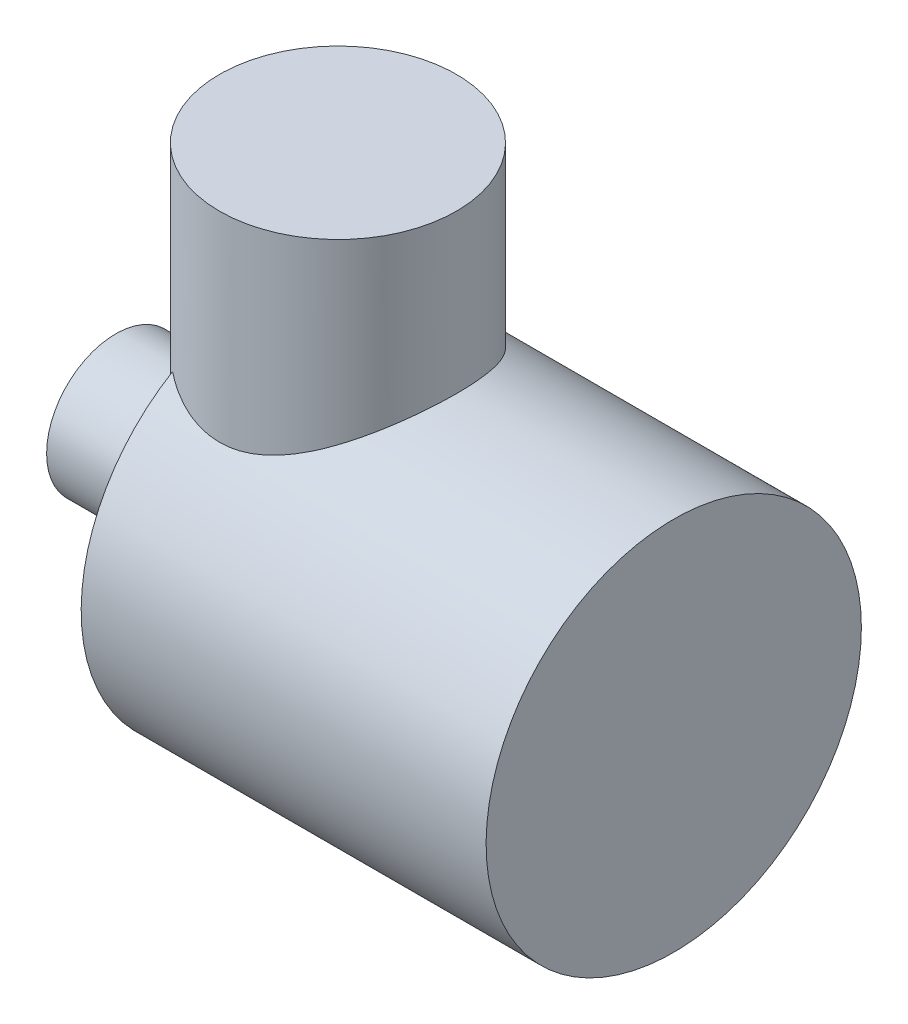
ISO-10303-21;
HEADER;
FILE_DESCRIPTION(('STEP AP214'),'2;1');
FILE_NAME('part.step','',(''),(''),'','','');
FILE_SCHEMA(('AUTOMOTIVE_DESIGN { 1 0 10303 214 1 1 1 1 }'));
ENDSEC;
DATA;
#1=APPLICATION_CONTEXT('core data for automotive mechanical design processes');
#2=APPLICATION_PROTOCOL_DEFINITION('international standard','automotive_design',2000,#1);
#3=PRODUCT_CONTEXT('',#1,'mechanical');
#4=PRODUCT('Part','Part','',(#3));
#5=PRODUCT_RELATED_PRODUCT_CATEGORY('part','',(#4));
#6=PRODUCT_DEFINITION_FORMATION('','',#4);
#7=PRODUCT_DEFINITION_CONTEXT('part definition',#1,'design');
#8=PRODUCT_DEFINITION('design','',#6,#7);
#9=PRODUCT_DEFINITION_SHAPE('','',#8);
#10=(LENGTH_UNIT() NAMED_UNIT(*) SI_UNIT(.MILLI.,.METRE.));
#11=(NAMED_UNIT(*) PLANE_ANGLE_UNIT() SI_UNIT($,.RADIAN.));
#12=(NAMED_UNIT(*) SI_UNIT($,.STERADIAN.) SOLID_ANGLE_UNIT());
#13=UNCERTAINTY_MEASURE_WITH_UNIT(LENGTH_MEASURE(1.E-05),#10,'distance_accuracy_value','');
#14=(GEOMETRIC_REPRESENTATION_CONTEXT(3) GLOBAL_UNCERTAINTY_ASSIGNED_CONTEXT((#13)) GLOBAL_UNIT_ASSIGNED_CONTEXT((#10,
#11,#12)) REPRESENTATION_CONTEXT('',''));
#15=CARTESIAN_POINT('',(0.,0.,0.));
#16=DIRECTION('',(0.,0.,1.));
#17=DIRECTION('',(1.,0.,0.));
#18=AXIS2_PLACEMENT_3D('',#15,#16,#17);
#19=CARTESIAN_POINT('',(-62.,0.,0.));
#20=DIRECTION('',(1.,0.,0.));
#21=DIRECTION('',(0.,0.,-1.));
#22=AXIS2_PLACEMENT_3D('',#19,#20,#21);
#23=CYLINDRICAL_SURFACE('',#22,28.);
#24=CARTESIAN_POINT('',(-62.,0.,0.));
#25=DIRECTION('',(-1.,0.,0.));
#26=DIRECTION('',(0.,0.,1.));
#27=AXIS2_PLACEMENT_3D('',#24,#25,#26);
#28=CIRCLE('',#27,28.);
#29=CARTESIAN_POINT('',(-62.,0.,28.));
#30=VERTEX_POINT('',#29);
#31=EDGE_CURVE('E138',#30,#30,#28,.T.);
#32=ORIENTED_EDGE('',*,*,#31,.F.);
#33=EDGE_LOOP('',(#32));
#34=FACE_BOUND('',#33,.T.);
#35=DIRECTION('',(1.,0.,0.));
#36=VECTOR('',#35,1.);
#37=CARTESIAN_POINT('',(-62.,-20.,19.5959179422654));
#38=LINE('',#37,#36);
#39=CARTESIAN_POINT('',(-15.8178046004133,-20.,19.5959179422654));
#40=VERTEX_POINT('',#39);
#41=CARTESIAN_POINT('',(0.,-20.,19.5959179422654));
#42=VERTEX_POINT('',#41);
#43=EDGE_CURVE('E11',#40,#42,#38,.T.);
#44=ORIENTED_EDGE('',*,*,#43,.F.);
#45=CARTESIAN_POINT('',(-15.8178046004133,-20.,19.5959179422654));
#46=CARTESIAN_POINT('',(-15.6934629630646,-19.7275715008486,19.8739575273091));
#47=CARTESIAN_POINT('',(-15.5685520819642,-19.4495092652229,20.1461614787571));
#48=CARTESIAN_POINT('',(-15.3183510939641,-18.8823827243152,20.6786600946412));
#49=CARTESIAN_POINT('',(-15.1930609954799,-18.5933186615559,20.9389550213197));
#50=CARTESIAN_POINT('',(-14.8176956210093,-17.7098697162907,21.7017527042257));
#51=CARTESIAN_POINT('',(-14.5681824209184,-17.0993520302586,22.1860418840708));
#52=CARTESIAN_POINT('',(-14.0749550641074,-15.8317996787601,23.1078793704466));
#53=CARTESIAN_POINT('',(-13.8313197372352,-15.1743741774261,23.5449334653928));
#54=CARTESIAN_POINT('',(-13.4775788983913,-14.1594504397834,24.1591872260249));
#55=CARTESIAN_POINT('',(-13.3616197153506,-13.8163527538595,24.3570467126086));
#56=CARTESIAN_POINT('',(-13.1344753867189,-13.1207166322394,24.7387198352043));
#57=CARTESIAN_POINT('',(-13.0232919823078,-12.7681748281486,24.9225283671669));
#58=CARTESIAN_POINT('',(-12.6975206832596,-11.694218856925,25.453580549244));
#59=CARTESIAN_POINT('',(-12.491639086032,-10.9590973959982,25.7788594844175));
#60=CARTESIAN_POINT('',(-12.1110795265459,-9.45653993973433,26.3671063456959));
#61=CARTESIAN_POINT('',(-11.9363950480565,-8.68911073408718,26.6300872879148));
#62=CARTESIAN_POINT('',(-11.7038557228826,-7.51942116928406,26.9744843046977));
#63=CARTESIAN_POINT('',(-11.6313712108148,-7.12722481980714,27.080777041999));
#64=CARTESIAN_POINT('',(-11.4969030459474,-6.33694195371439,27.2765243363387));
#65=CARTESIAN_POINT('',(-11.4349168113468,-5.93885691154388,27.3659830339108));
#66=CARTESIAN_POINT('',(-11.3222345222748,-5.13764462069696,27.5276515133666));
#67=CARTESIAN_POINT('',(-11.2715375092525,-4.73451780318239,27.5998627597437));
#68=CARTESIAN_POINT('',(-11.1821015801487,-3.9242053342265,27.7266816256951));
#69=CARTESIAN_POINT('',(-11.1433629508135,-3.51701958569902,27.781288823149));
#70=CARTESIAN_POINT('',(-11.0542641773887,-2.3956640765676,27.9065307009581));
#71=CARTESIAN_POINT('',(-11.0166713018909,-1.67829831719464,27.9589046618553));
#72=CARTESIAN_POINT('',(-10.981296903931,-0.240827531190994,28.0082013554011));
#73=CARTESIAN_POINT('',(-10.9835118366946,0.479277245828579,28.0051290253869));
#74=CARTESIAN_POINT('',(-11.0276357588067,1.91637493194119,27.9436051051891));
#75=CARTESIAN_POINT('',(-11.0695711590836,2.63336545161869,27.8851166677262));
#76=CARTESIAN_POINT('',(-11.1913245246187,4.05750840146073,27.7137341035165));
#77=CARTESIAN_POINT('',(-11.271142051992,4.76466094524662,27.6008406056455));
#78=CARTESIAN_POINT('',(-11.4553509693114,6.09193386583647,27.3367570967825));
#79=CARTESIAN_POINT('',(-11.5563888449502,6.71355101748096,27.190672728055));
#80=CARTESIAN_POINT('',(-11.7831726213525,7.9413462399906,26.857768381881));
#81=CARTESIAN_POINT('',(-11.9089260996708,8.54751951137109,26.6709359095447));
#82=CARTESIAN_POINT('',(-12.1815661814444,9.74146498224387,26.2583853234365));
#83=CARTESIAN_POINT('',(-12.3284504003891,10.3292392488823,26.0326715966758));
#84=CARTESIAN_POINT('',(-12.6396493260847,11.4843614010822,25.5441335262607));
#85=CARTESIAN_POINT('',(-12.803964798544,12.0517083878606,25.2813075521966));
#86=CARTESIAN_POINT('',(-13.1687942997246,13.2373817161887,24.6833661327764));
#87=CARTESIAN_POINT('',(-13.3712282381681,13.8526177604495,24.3432900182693));
#88=CARTESIAN_POINT('',(-13.7883470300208,15.0526578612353,23.6200818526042));
#89=CARTESIAN_POINT('',(-14.0030298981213,15.6374668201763,23.2369567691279));
#90=CARTESIAN_POINT('',(-14.4398658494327,16.7755343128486,22.4291943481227));
#91=CARTESIAN_POINT('',(-14.6620251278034,17.3287656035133,22.00452199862));
#92=CARTESIAN_POINT('',(-15.1088836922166,18.4014568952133,21.1156728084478));
#93=CARTESIAN_POINT('',(-15.3335831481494,18.9209146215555,20.6514933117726));
#94=CARTESIAN_POINT('',(-15.8170359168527,20.0051134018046,19.6073803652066));
#95=CARTESIAN_POINT('',(-16.0754453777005,20.563673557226,19.020844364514));
#96=CARTESIAN_POINT('',(-16.5828097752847,21.6297644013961,17.7991745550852));
#97=CARTESIAN_POINT('',(-16.831763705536,22.1372896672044,17.1640355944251));
#98=CARTESIAN_POINT('',(-17.3137413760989,23.0977861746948,15.8479003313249));
#99=CARTESIAN_POINT('',(-17.5467634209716,23.5507516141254,15.1668991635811));
#100=CARTESIAN_POINT('',(-17.9906098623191,24.3980826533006,13.7624854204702));
#101=CARTESIAN_POINT('',(-18.2014356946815,24.7924520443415,13.0390755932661));
#102=CARTESIAN_POINT('',(-18.5917145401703,25.5123067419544,11.5664408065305));
#103=CARTESIAN_POINT('',(-18.7716333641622,25.8388339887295,10.8178501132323));
#104=CARTESIAN_POINT('',(-19.0991640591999,26.4270880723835,9.28870083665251));
#105=CARTESIAN_POINT('',(-19.2467756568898,26.6888143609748,8.50814198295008));
#106=CARTESIAN_POINT('',(-19.5050391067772,27.1433916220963,6.92213992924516));
#107=CARTESIAN_POINT('',(-19.6157308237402,27.3363168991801,6.1167246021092));
#108=CARTESIAN_POINT('',(-19.7967845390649,27.6504823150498,4.48760999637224));
#109=CARTESIAN_POINT('',(-19.8671531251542,27.7717341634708,3.66391372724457));
#110=CARTESIAN_POINT('',(-19.9587374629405,27.9292661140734,2.11628020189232));
#111=CARTESIAN_POINT('',(-19.9852257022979,27.9746678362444,1.39356706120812));
#112=CARTESIAN_POINT('',(-20.0054225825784,28.0092991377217,-0.0536260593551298));
#113=CARTESIAN_POINT('',(-19.9991345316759,27.9985343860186,-0.778105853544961));
#114=CARTESIAN_POINT('',(-19.953947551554,27.920996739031,-2.22290043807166));
#115=CARTESIAN_POINT('',(-19.9150538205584,27.8542327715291,-2.94321587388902));
#116=CARTESIAN_POINT('',(-19.8056652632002,27.6656381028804,-4.37415647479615));
#117=CARTESIAN_POINT('',(-19.7351704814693,27.5438074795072,-5.08478165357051));
#118=CARTESIAN_POINT('',(-19.5690710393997,27.2549014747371,-6.45224809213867));
#119=CARTESIAN_POINT('',(-19.4750660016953,27.0906926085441,-7.10989385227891));
#120=CARTESIAN_POINT('',(-19.2624643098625,26.7163668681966,-8.40784923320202));
#121=CARTESIAN_POINT('',(-19.1438689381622,26.5062523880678,-9.04815975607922));
#122=CARTESIAN_POINT('',(-18.8845125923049,26.0421684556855,-10.3080657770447));
#123=CARTESIAN_POINT('',(-18.7437501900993,25.7881961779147,-10.9276599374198));
#124=CARTESIAN_POINT('',(-18.4428114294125,25.2386131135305,-12.1432033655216));
#125=CARTESIAN_POINT('',(-18.282633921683,24.9429998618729,-12.7391512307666));
#126=CARTESIAN_POINT('',(-17.9326089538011,24.2875949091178,-13.950757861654));
#127=CARTESIAN_POINT('',(-17.7414192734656,23.9245861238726,-14.5642885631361));
#128=CARTESIAN_POINT('',(-17.3438664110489,23.1554443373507,-15.7584872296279));
#129=CARTESIAN_POINT('',(-17.1375025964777,22.7493095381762,-16.3391538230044));
#130=CARTESIAN_POINT('',(-16.7135542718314,21.8960980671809,-17.4659875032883));
#131=CARTESIAN_POINT('',(-16.4959611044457,21.4489895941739,-18.0121272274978));
#132=CARTESIAN_POINT('',(-16.0539785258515,20.5163747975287,-19.0676272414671));
#133=CARTESIAN_POINT('',(-15.8295887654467,20.030866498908,-19.5769856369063));
#134=CARTESIAN_POINT('',(-15.3490075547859,18.9577360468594,-20.6212391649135));
#135=CARTESIAN_POINT('',(-15.0924862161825,18.3650552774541,-21.150797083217));
#136=CARTESIAN_POINT('',(-14.5831317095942,17.1358110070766,-22.1584224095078));
#137=CARTESIAN_POINT('',(-14.3302990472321,16.4992415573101,-22.6364828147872));
#138=CARTESIAN_POINT('',(-13.8355915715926,15.1850943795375,-23.5382164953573));
#139=CARTESIAN_POINT('',(-13.5937117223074,14.5075358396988,-23.961914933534));
#140=CARTESIAN_POINT('',(-13.1282573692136,13.113546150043,-24.7523112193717));
#141=CARTESIAN_POINT('',(-12.9046880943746,12.3971039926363,-25.1189928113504));
#142=CARTESIAN_POINT('',(-12.5173207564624,11.0455071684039,-25.7382625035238));
#143=CARTESIAN_POINT('',(-12.3496690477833,10.4155132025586,-25.9997218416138));
#144=CARTESIAN_POINT('',(-12.0378639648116,9.13328379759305,-26.4773639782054));
#145=CARTESIAN_POINT('',(-11.89369701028,8.48106147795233,-26.693572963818));
#146=CARTESIAN_POINT('',(-11.6334935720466,7.15780173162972,-27.0784081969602));
#147=CARTESIAN_POINT('',(-11.5174333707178,6.48678070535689,-27.2470745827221));
#148=CARTESIAN_POINT('',(-11.3174346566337,5.12943282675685,-27.5348894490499));
#149=CARTESIAN_POINT('',(-11.2334960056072,4.44310604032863,-27.654038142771));
#150=CARTESIAN_POINT('',(-11.1006498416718,3.05612186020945,-27.8415616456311));
#151=CARTESIAN_POINT('',(-11.0519447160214,2.35540508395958,-27.909643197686));
#152=CARTESIAN_POINT('',(-10.9924046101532,0.949207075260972,-27.9927676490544));
#153=CARTESIAN_POINT('',(-10.9815695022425,0.243725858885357,-28.007810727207));
#154=CARTESIAN_POINT('',(-10.998238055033,-1.16588998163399,-27.9845960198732));
#155=CARTESIAN_POINT('',(-11.0257415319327,-1.87002461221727,-27.9463384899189));
#156=CARTESIAN_POINT('',(-11.1179056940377,-3.2709482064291,-27.8171836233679));
#157=CARTESIAN_POINT('',(-11.1825651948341,-3.96773740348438,-27.7262879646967));
#158=CARTESIAN_POINT('',(-11.3393584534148,-5.28946853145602,-27.5033027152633));
#159=CARTESIAN_POINT('',(-11.4286721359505,-5.91546172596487,-27.375397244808));
#160=CARTESIAN_POINT('',(-11.633261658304,-7.15317918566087,-27.0783503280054));
#161=CARTESIAN_POINT('',(-11.7485359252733,-7.7649043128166,-26.9092113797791));
#162=CARTESIAN_POINT('',(-12.0017736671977,-8.9716389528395,-26.5312987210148));
#163=CARTESIAN_POINT('',(-12.1397541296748,-9.56663555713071,-26.3224953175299));
#164=CARTESIAN_POINT('',(-12.4346998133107,-10.7371234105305,-25.8671336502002));
#165=CARTESIAN_POINT('',(-12.5916659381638,-11.3126137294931,-25.6205735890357));
#166=CARTESIAN_POINT('',(-12.9395409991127,-12.5063171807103,-25.0614107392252));
#167=CARTESIAN_POINT('',(-13.132280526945,-13.1219741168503,-24.7444893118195));
#168=CARTESIAN_POINT('',(-13.5316648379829,-14.3248447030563,-24.0681334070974));
#169=CARTESIAN_POINT('',(-13.7383120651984,-14.9120533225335,-23.7086914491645));
#170=CARTESIAN_POINT('',(-14.1603903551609,-16.055546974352,-22.9497240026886));
#171=CARTESIAN_POINT('',(-14.3758112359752,-16.6118661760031,-22.5502442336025));
#172=CARTESIAN_POINT('',(-14.8109938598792,-17.69253241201,-21.7127000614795));
#173=CARTESIAN_POINT('',(-15.0307537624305,-18.2168926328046,-21.2746517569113));
#174=CARTESIAN_POINT('',(-15.3453211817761,-18.9434901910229,-20.6211295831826));
#175=CARTESIAN_POINT('',(-15.4401443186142,-19.1593959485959,-20.4206851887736));
#176=CARTESIAN_POINT('',(-15.6293540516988,-19.5846041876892,-20.0132418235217));
#177=CARTESIAN_POINT('',(-15.7237410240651,-19.7939139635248,-19.8062506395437));
#178=CARTESIAN_POINT('',(-15.8178046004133,-20.,-19.5959179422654));
#179=B_SPLINE_CURVE_WITH_KNOTS('',3,(#45,#46,#47,#48,#49,#50,#51,#52,#53,#54,#55,#56,#57,#58,
#59,#60,#61,#62,#63,#64,#65,#66,#67,#68,#69,#70,#71,#72,#73,#74,#75,#76,#77,#78,#79,#80,#81,#82,
#83,#84,#85,#86,#87,#88,#89,#90,#91,#92,#93,#94,#95,#96,#97,#98,#99,#100,#101,#102,#103,#104,
#105,#106,#107,#108,#109,#110,#111,#112,#113,#114,#115,#116,#117,#118,#119,#120,#121,#122,#123,
#124,#125,#126,#127,#128,#129,#130,#131,#132,#133,#134,#135,#136,#137,#138,#139,#140,#141,#142,
#143,#144,#145,#146,#147,#148,#149,#150,#151,#152,#153,#154,#155,#156,#157,#158,#159,#160,#161,
#162,#163,#164,#165,#166,#167,#168,#169,#170,#171,#172,#173,#174,#175,#176,#177,#178),
.UNSPECIFIED.,.F.,.F.,(4,2,2,2,2,2,2,2,2,2,2,2,2,2,2,2,2,2,2,2,2,2,2,2,2,2,2,2,2,2,2,2,2,2,2,2,
2,2,2,2,2,2,2,2,2,2,2,2,2,2,2,2,2,2,2,2,2,2,2,2,2,2,2,2,2,2,4),(0.,1.2257478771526,
2.45146874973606,4.90346714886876,7.37904266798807,8.61677636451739,9.85495755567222,
12.3409029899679,14.8263285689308,16.0641714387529,17.3017094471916,18.5391423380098,
19.7766048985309,21.9339446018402,24.0910922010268,26.2496751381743,28.4082331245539,
30.3457440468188,32.2838499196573,34.2217372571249,36.1597097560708,38.3521973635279,
40.5443306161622,42.7383273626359,44.9324717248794,47.4799929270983,50.0277845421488,
52.5758468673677,55.1237442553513,57.6290203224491,60.1343175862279,62.6369008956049,
65.139075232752,67.310109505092,69.4809246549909,71.6513937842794,73.8218598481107,
75.8725982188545,77.9232296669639,79.9739932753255,82.024878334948,84.2368408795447,
86.4488956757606,88.662682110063,90.8765824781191,93.379299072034,95.8823555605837,
98.384249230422,100.886854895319,102.992007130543,105.095937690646,107.198086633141,
109.300226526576,111.414347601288,113.528461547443,115.642565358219,117.756601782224,
119.68997867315,121.623238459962,123.557951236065,125.492756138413,127.646976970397,
129.801577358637,131.953744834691,134.105018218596,135.033376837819,135.960669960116),.UNSPECIFIED.);
#180=CARTESIAN_POINT('',(-15.8178046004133,-20.,-19.5959179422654));
#181=VERTEX_POINT('',#180);
#182=EDGE_CURVE('E40',#40,#181,#179,.T.);
#183=ORIENTED_EDGE('',*,*,#182,.T.);
#184=DIRECTION('',(1.,0.,0.));
#185=VECTOR('',#184,1.);
#186=CARTESIAN_POINT('',(-62.,-20.,-19.5959179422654));
#187=LINE('',#186,#185);
#188=CARTESIAN_POINT('',(0.,-20.,-19.5959179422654));
#189=VERTEX_POINT('',#188);
#190=EDGE_CURVE('E75',#189,#181,#187,.F.);
#191=ORIENTED_EDGE('',*,*,#190,.F.);
#192=CARTESIAN_POINT('',(0.,0.,0.));
#193=DIRECTION('',(1.,0.,0.));
#194=DIRECTION('',(0.,0.,-1.));
#195=AXIS2_PLACEMENT_3D('',#192,#193,#194);
#196=CIRCLE('',#195,28.);
#197=EDGE_CURVE('E84',#189,#42,#196,.F.);
#198=ORIENTED_EDGE('',*,*,#197,.T.);
#199=EDGE_LOOP('',(#44,#183,#191,#198));
#200=FACE_BOUND('',#199,.T.);
#201=ADVANCED_FACE('F31',(#34,#200),#23,.T.);
#202=CARTESIAN_POINT('',(0.,0.,0.));
#203=DIRECTION('',(1.,0.,0.));
#204=DIRECTION('',(0.,0.,-1.));
#205=AXIS2_PLACEMENT_3D('',#202,#203,#204);
#206=PLANE('',#205);
#207=DIRECTION('',(0.,0.,1.));
#208=VECTOR('',#207,1.);
#209=CARTESIAN_POINT('',(0.,-20.,0.));
#210=LINE('',#209,#208);
#211=CARTESIAN_POINT('',(0.,-20.,-38.9871773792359));
#212=VERTEX_POINT('',#211);
#213=EDGE_CURVE('E47',#212,#189,#210,.T.);
#214=ORIENTED_EDGE('',*,*,#213,.F.);
#215=DIRECTION('',(0.,1.,0.));
#216=VECTOR('',#215,1.);
#217=CARTESIAN_POINT('',(0.,-20.,-38.9871773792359));
#218=LINE('',#217,#216);
#219=CARTESIAN_POINT('',(0.,65.2380257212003,-38.9871773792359));
#220=VERTEX_POINT('',#219);
#221=EDGE_CURVE('E88',#212,#220,#218,.T.);
#222=ORIENTED_EDGE('',*,*,#221,.T.);
#223=CARTESIAN_POINT('',(0.,0.,0.));
#224=DIRECTION('',(1.,0.,0.));
#225=DIRECTION('',(0.,0.,-1.));
#226=AXIS2_PLACEMENT_3D('',#223,#224,#225);
#227=CIRCLE('',#226,76.);
#228=CARTESIAN_POINT('',(0.,65.2380257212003,38.9871773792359));
#229=VERTEX_POINT('',#228);
#230=EDGE_CURVE('E137',#229,#220,#227,.T.);
#231=ORIENTED_EDGE('',*,*,#230,.F.);
#232=DIRECTION('',(0.,1.,0.));
#233=VECTOR('',#232,1.);
#234=CARTESIAN_POINT('',(0.,-20.,38.9871773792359));
#235=LINE('',#234,#233);
#236=CARTESIAN_POINT('',(0.,-20.,38.9871773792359));
#237=VERTEX_POINT('',#236);
#238=EDGE_CURVE('E54',#229,#237,#235,.F.);
#239=ORIENTED_EDGE('',*,*,#238,.T.);
#240=EDGE_CURVE('E91',#42,#237,#210,.T.);
#241=ORIENTED_EDGE('',*,*,#240,.F.);
#242=ORIENTED_EDGE('',*,*,#197,.F.);
#243=EDGE_LOOP('',(#214,#222,#231,#239,#241,#242));
#244=FACE_BOUND('',#243,.T.);
#245=ADVANCED_FACE('F120',(#244),#206,.F.);
#246=CARTESIAN_POINT('',(164.,0.,0.));
#247=DIRECTION('',(-1.,0.,0.));
#248=DIRECTION('',(0.,0.,1.));
#249=AXIS2_PLACEMENT_3D('',#246,#247,#248);
#250=CYLINDRICAL_SURFACE('',#249,76.);
#251=CARTESIAN_POINT('',(164.,0.,0.));
#252=DIRECTION('',(1.,0.,0.));
#253=DIRECTION('',(0.,0.,-1.));
#254=AXIS2_PLACEMENT_3D('',#251,#252,#253);
#255=CIRCLE('',#254,76.);
#256=CARTESIAN_POINT('',(164.,0.,-76.));
#257=VERTEX_POINT('',#256);
#258=EDGE_CURVE('E135',#257,#257,#255,.T.);
#259=ORIENTED_EDGE('',*,*,#258,.F.);
#260=EDGE_LOOP('',(#259));
#261=FACE_BOUND('',#260,.T.);
#262=ORIENTED_EDGE('',*,*,#230,.T.);
#263=CARTESIAN_POINT('',(0.,65.2380257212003,-38.9871773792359));
#264=CARTESIAN_POINT('',(0.48940989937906,65.0279799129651,-39.3386543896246));
#265=CARTESIAN_POINT('',(0.985804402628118,64.8194133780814,-39.6811982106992));
#266=CARTESIAN_POINT('',(1.99238995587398,64.4064039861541,-40.3480972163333));
#267=CARTESIAN_POINT('',(2.50258197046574,64.2019614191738,-40.6724511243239));
#268=CARTESIAN_POINT('',(4.05421091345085,63.5963305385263,-41.6181113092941));
#269=CARTESIAN_POINT('',(5.11601844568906,63.2031349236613,-42.2115254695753));
#270=CARTESIAN_POINT('',(7.30137314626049,62.4449596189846,-43.3253460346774));
#271=CARTESIAN_POINT('',(8.42542305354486,62.0802939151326,-43.8449806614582));
#272=CARTESIAN_POINT('',(10.7216720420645,61.3949529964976,-44.7996096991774));
#273=CARTESIAN_POINT('',(11.8938598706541,61.0742675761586,-45.2346237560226));
#274=CARTESIAN_POINT('',(14.2899562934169,60.486436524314,-46.0177473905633));
#275=CARTESIAN_POINT('',(15.5141677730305,60.219678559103,-46.3652318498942));
#276=CARTESIAN_POINT('',(17.377197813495,59.8704499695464,-46.8141521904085));
#277=CARTESIAN_POINT('',(18.0027856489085,59.7625089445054,-46.9517611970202));
#278=CARTESIAN_POINT('',(19.2617112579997,59.5648520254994,-47.2022664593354));
#279=CARTESIAN_POINT('',(19.8950479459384,59.4751336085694,-47.3151661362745));
#280=CARTESIAN_POINT('',(21.1650198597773,59.3154449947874,-47.5152004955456));
#281=CARTESIAN_POINT('',(21.8016237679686,59.2453802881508,-47.60245858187));
#282=CARTESIAN_POINT('',(23.0796113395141,59.1253379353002,-47.7514771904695));
#283=CARTESIAN_POINT('',(23.7209943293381,59.075357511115,-47.813241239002));
#284=CARTESIAN_POINT('',(25.0069636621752,58.996157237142,-47.9109323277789));
#285=CARTESIAN_POINT('',(25.6515497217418,58.9669355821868,-47.9468616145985));
#286=CARTESIAN_POINT('',(26.9421887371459,58.9296403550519,-47.9926890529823));
#287=CARTESIAN_POINT('',(27.5882416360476,58.9215659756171,-48.0025881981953));
#288=CARTESIAN_POINT('',(29.3440206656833,58.9285756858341,-47.9940002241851));
#289=CARTESIAN_POINT('',(30.4537132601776,58.9644422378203,-47.9500381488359));
#290=CARTESIAN_POINT('',(32.6634200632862,59.0976329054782,-47.7857775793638));
#291=CARTESIAN_POINT('',(33.7634351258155,59.1949515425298,-47.6654858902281));
#292=CARTESIAN_POINT('',(35.9477954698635,59.4473589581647,-47.3503136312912));
#293=CARTESIAN_POINT('',(37.0321123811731,59.6025413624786,-47.1553121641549));
#294=CARTESIAN_POINT('',(39.1764353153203,59.9649517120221,-46.6935802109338));
#295=CARTESIAN_POINT('',(40.2364401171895,60.1721822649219,-46.426846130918));
#296=CARTESIAN_POINT('',(42.3072848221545,60.6275238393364,-45.8305712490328));
#297=CARTESIAN_POINT('',(43.3186718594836,60.8748058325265,-45.5022863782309));
#298=CARTESIAN_POINT('',(45.3091448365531,61.4059139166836,-44.7829592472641));
#299=CARTESIAN_POINT('',(46.2882269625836,61.6897443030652,-44.3919096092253));
#300=CARTESIAN_POINT('',(47.7301359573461,62.1375040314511,-43.7606803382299));
#301=CARTESIAN_POINT('',(48.2063345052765,62.2904314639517,-43.542820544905));
#302=CARTESIAN_POINT('',(49.1495227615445,62.6027506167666,-43.0925825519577));
#303=CARTESIAN_POINT('',(49.6165145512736,62.7621408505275,-42.8602076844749));
#304=CARTESIAN_POINT('',(51.00358297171,63.2488328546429,-42.1416635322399));
#305=CARTESIAN_POINT('',(51.9096931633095,63.5846372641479,-41.6341007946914));
#306=CARTESIAN_POINT('',(53.8689556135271,64.3445785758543,-40.45203395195));
#307=CARTESIAN_POINT('',(54.9130120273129,64.7724528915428,-39.76485869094));
#308=CARTESIAN_POINT('',(56.9410436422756,65.6410262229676,-38.3141043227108));
#309=CARTESIAN_POINT('',(57.9250127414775,66.081726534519,-37.5505174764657));
#310=CARTESIAN_POINT('',(59.8310288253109,66.9664176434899,-35.949083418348));
#311=CARTESIAN_POINT('',(60.7530072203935,67.4104115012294,-35.1111562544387));
#312=CARTESIAN_POINT('',(62.5306837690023,68.2918179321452,-33.3644228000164));
#313=CARTESIAN_POINT('',(63.3863782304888,68.7292301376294,-32.4556125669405));
#314=CARTESIAN_POINT('',(65.1452647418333,69.6500643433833,-30.4347113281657));
#315=CARTESIAN_POINT('',(66.0377112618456,70.1311052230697,-29.3121468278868));
#316=CARTESIAN_POINT('',(67.7244800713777,71.0601069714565,-26.9820944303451));
#317=CARTESIAN_POINT('',(68.5187911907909,71.5080640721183,-25.7745968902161));
#318=CARTESIAN_POINT('',(69.6302492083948,72.1455886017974,-23.9049815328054));
#319=CARTESIAN_POINT('',(69.9873609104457,72.3523379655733,-23.2721307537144));
#320=CARTESIAN_POINT('',(70.6740072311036,72.752959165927,-21.9877051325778));
#321=CARTESIAN_POINT('',(71.0035454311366,72.9468326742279,-21.3361327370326));
#322=CARTESIAN_POINT('',(71.6339863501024,73.3202583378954,-20.0152649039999));
#323=CARTESIAN_POINT('',(71.9348887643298,73.4998103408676,-19.3459692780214));
#324=CARTESIAN_POINT('',(72.5069340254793,73.8431773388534,-17.9909291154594));
#325=CARTESIAN_POINT('',(72.7780814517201,74.0069947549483,-17.3051871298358));
#326=CARTESIAN_POINT('',(73.2685023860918,74.3047949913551,-15.9756849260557));
#327=CARTESIAN_POINT('',(73.4902094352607,74.4401239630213,-15.3331229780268));
#328=CARTESIAN_POINT('',(73.9068717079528,74.69547353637,-14.0364796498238));
#329=CARTESIAN_POINT('',(74.1018308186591,74.8154963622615,-13.382399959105));
#330=CARTESIAN_POINT('',(74.4642960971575,75.0393929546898,-12.0638600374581));
#331=CARTESIAN_POINT('',(74.6317991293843,75.1432648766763,-11.3993986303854));
#332=CARTESIAN_POINT('',(74.9386144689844,75.3340500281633,-10.0616754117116));
#333=CARTESIAN_POINT('',(75.0779304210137,75.4209654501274,-9.38841474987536));
#334=CARTESIAN_POINT('',(75.3276800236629,75.5771116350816,-8.03515311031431));
#335=CARTESIAN_POINT('',(75.4381395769,75.6463582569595,-7.3551587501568));
#336=CARTESIAN_POINT('',(75.6298281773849,75.7667141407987,-5.98955957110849));
#337=CARTESIAN_POINT('',(75.7110611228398,75.8178258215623,-5.30395551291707));
#338=CARTESIAN_POINT('',(75.8439315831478,75.9015092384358,-3.928778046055));
#339=CARTESIAN_POINT('',(75.8955706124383,75.9340819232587,-3.23920484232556));
#340=CARTESIAN_POINT('',(75.9690180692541,75.9804314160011,-1.85791560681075));
#341=CARTESIAN_POINT('',(75.9908276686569,75.9942089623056,-1.16619966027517));
#342=CARTESIAN_POINT('',(76.0093265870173,76.0058870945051,0.708088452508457));
#343=CARTESIAN_POINT('',(75.9772732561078,75.9856247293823,1.8912352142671));
#344=CARTESIAN_POINT('',(75.8261311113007,75.8902860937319,4.249425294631));
#345=CARTESIAN_POINT('',(75.7070527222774,75.8152163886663,5.42446956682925));
#346=CARTESIAN_POINT('',(75.3835354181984,75.6120597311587,7.75809646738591));
#347=CARTESIAN_POINT('',(75.1790964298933,75.4839727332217,8.91667908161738));
#348=CARTESIAN_POINT('',(74.687519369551,75.177706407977,11.2093845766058));
#349=CARTESIAN_POINT('',(74.4003786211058,74.9995254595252,12.3435066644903));
#350=CARTESIAN_POINT('',(73.7527155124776,74.6005839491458,14.5601672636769));
#351=CARTESIAN_POINT('',(73.3935987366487,74.3806426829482,15.6432657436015));
#352=CARTESIAN_POINT('',(72.602691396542,73.9006178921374,17.7733134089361));
#353=CARTESIAN_POINT('',(72.1709027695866,73.6405354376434,18.8202635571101));
#354=CARTESIAN_POINT('',(71.2385535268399,73.0851032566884,20.8734002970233));
#355=CARTESIAN_POINT('',(70.7379880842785,72.7897510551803,21.8795840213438));
#356=CARTESIAN_POINT('',(69.6720181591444,72.1690332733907,23.8473319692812));
#357=CARTESIAN_POINT('',(69.1066095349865,71.8436657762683,24.8088933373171));
#358=CARTESIAN_POINT('',(67.8458287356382,71.1293876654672,26.7926492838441));
#359=CARTESIAN_POINT('',(67.142988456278,70.7374781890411,27.8090211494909));
#360=CARTESIAN_POINT('',(65.6660039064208,69.9310019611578,29.7789870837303));
#361=CARTESIAN_POINT('',(64.8918550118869,69.5164337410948,30.7325770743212));
#362=CARTESIAN_POINT('',(63.2754342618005,68.6722692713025,32.5752609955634));
#363=CARTESIAN_POINT('',(62.4330815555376,68.2426555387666,33.4642759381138));
#364=CARTESIAN_POINT('',(60.6846098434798,67.3773448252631,35.1740187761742));
#365=CARTESIAN_POINT('',(59.7784876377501,66.9416475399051,35.9947432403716));
#366=CARTESIAN_POINT('',(57.7717293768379,66.0110323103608,37.6775122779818));
#367=CARTESIAN_POINT('',(56.6617898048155,65.5165378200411,38.5287346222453));
#368=CARTESIAN_POINT('',(54.3663255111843,64.5453454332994,40.1345129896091));
#369=CARTESIAN_POINT('',(53.1807867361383,64.0686508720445,40.8890509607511));
#370=CARTESIAN_POINT('',(50.7393933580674,63.1490509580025,42.2954207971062));
#371=CARTESIAN_POINT('',(49.483608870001,62.7061129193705,42.9473526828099));
#372=CARTESIAN_POINT('',(46.9056708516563,61.8703451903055,44.1428653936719));
#373=CARTESIAN_POINT('',(45.5835416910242,61.4774972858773,44.6864856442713));
#374=CARTESIAN_POINT('',(43.210505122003,60.8472673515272,45.5391963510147));
#375=CARTESIAN_POINT('',(42.1723312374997,60.5953594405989,45.8731307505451));
#376=CARTESIAN_POINT('',(40.0661955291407,60.1376529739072,46.4715481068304));
#377=CARTESIAN_POINT('',(38.9982380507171,59.931847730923,46.7360411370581));
#378=CARTESIAN_POINT('',(36.839485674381,59.5735298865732,47.1919350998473));
#379=CARTESIAN_POINT('',(35.7487233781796,59.4209460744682,47.383433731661));
#380=CARTESIAN_POINT('',(33.5499625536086,59.1743955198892,47.6909842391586));
#381=CARTESIAN_POINT('',(32.4419639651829,59.080428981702,47.8070358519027));
#382=CARTESIAN_POINT('',(30.2122402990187,58.9546438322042,47.962069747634));
#383=CARTESIAN_POINT('',(29.0904767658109,58.9230929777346,48.000719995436));
#384=CARTESIAN_POINT('',(26.8470302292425,58.9242824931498,47.9992596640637));
#385=CARTESIAN_POINT('',(25.7253472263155,58.9570231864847,47.9591486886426));
#386=CARTESIAN_POINT('',(23.49055313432,59.0854437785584,47.8008429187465));
#387=CARTESIAN_POINT('',(22.377447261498,59.1811593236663,47.6826039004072));
#388=CARTESIAN_POINT('',(20.168811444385,59.4316694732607,47.3699965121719));
#389=CARTESIAN_POINT('',(19.0732813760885,59.5864636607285,47.1756286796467));
#390=CARTESIAN_POINT('',(16.9636211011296,59.9397770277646,46.7257986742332));
#391=CARTESIAN_POINT('',(15.9482316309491,60.1355835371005,46.4740667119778));
#392=CARTESIAN_POINT('',(13.9443339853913,60.5690068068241,45.9077598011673));
#393=CARTESIAN_POINT('',(12.9558261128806,60.8066240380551,45.5931841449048));
#394=CARTESIAN_POINT('',(11.0090195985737,61.317292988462,44.9040472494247));
#395=CARTESIAN_POINT('',(10.0507327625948,61.590358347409,44.5294629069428));
#396=CARTESIAN_POINT('',(8.16755075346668,62.1652803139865,43.7232531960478));
#397=CARTESIAN_POINT('',(7.24265113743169,62.4671330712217,43.2916354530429));
#398=CARTESIAN_POINT('',(5.7790698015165,62.972191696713,42.5513714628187));
#399=CARTESIAN_POINT('',(5.2292954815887,63.1684261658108,42.2596836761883));
#400=CARTESIAN_POINT('',(4.14349588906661,63.5679008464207,41.6563661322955));
#401=CARTESIAN_POINT('',(3.60746860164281,63.7711400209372,41.3447393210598));
#402=CARTESIAN_POINT('',(2.55123664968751,64.1825807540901,40.7030841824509));
#403=CARTESIAN_POINT('',(2.03098503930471,64.3907634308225,40.3731209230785));
#404=CARTESIAN_POINT('',(1.00471998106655,64.8114677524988,39.6942473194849));
#405=CARTESIAN_POINT('',(0.498707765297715,65.0239897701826,39.3453353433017));
#406=CARTESIAN_POINT('',(0.,65.2380257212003,38.9871773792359));
#407=B_SPLINE_CURVE_WITH_KNOTS('',3,(#263,#264,#265,#266,#267,#268,#269,#270,#271,#272,#273,
#274,#275,#276,#277,#278,#279,#280,#281,#282,#283,#284,#285,#286,#287,#288,#289,#290,#291,#292,
#293,#294,#295,#296,#297,#298,#299,#300,#301,#302,#303,#304,#305,#306,#307,#308,#309,#310,#311,
#312,#313,#314,#315,#316,#317,#318,#319,#320,#321,#322,#323,#324,#325,#326,#327,#328,#329,#330,
#331,#332,#333,#334,#335,#336,#337,#338,#339,#340,#341,#342,#343,#344,#345,#346,#347,#348,#349,
#350,#351,#352,#353,#354,#355,#356,#357,#358,#359,#360,#361,#362,#363,#364,#365,#366,#367,#368,
#369,#370,#371,#372,#373,#374,#375,#376,#377,#378,#379,#380,#381,#382,#383,#384,#385,#386,#387,
#388,#389,#390,#391,#392,#393,#394,#395,#396,#397,#398,#399,#400,#401,#402,#403,#404,#405,#406),
.UNSPECIFIED.,.F.,.F.,(4,2,2,2,2,2,2,2,2,2,2,2,2,2,2,2,2,2,2,2,2,2,2,2,2,2,2,2,2,2,2,2,2,2,2,2,
2,2,2,2,2,2,2,2,2,2,2,2,2,2,2,2,2,2,2,2,2,2,2,2,2,2,2,2,2,2,2,2,2,2,2,4),(0.,1.91410329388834,
3.82834075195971,7.65948194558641,11.5281371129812,15.3958930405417,19.2905348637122,
21.2386223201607,23.1864398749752,25.1247236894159,27.0627393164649,29.0005863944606,
30.938359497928,34.2670156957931,37.5953751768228,40.9291436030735,44.2630790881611,
47.5352121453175,50.8077301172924,52.4440922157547,54.0800800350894,57.3522580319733,
61.3118066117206,65.2717566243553,69.2360183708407,73.2005007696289,77.7326992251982,
82.2654130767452,84.5312052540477,86.7967026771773,89.0622242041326,91.3273965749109,
93.4058695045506,95.484040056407,97.5624477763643,99.6405865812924,101.716853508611,
103.792843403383,105.868727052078,107.944529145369,111.490930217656,115.036906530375,
118.582885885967,122.128980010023,125.611596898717,129.094120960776,132.576889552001,
136.059880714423,139.94512240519,143.830616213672,147.720785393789,151.611149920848,
156.056789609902,160.503258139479,164.945365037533,169.385852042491,172.740521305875,
176.094703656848,179.444380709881,182.794069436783,186.158097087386,189.522141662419,
192.888092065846,196.254018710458,199.443769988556,202.633557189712,205.824575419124,
209.015167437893,210.972430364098,212.929404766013,214.879830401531,216.830424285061),.UNSPECIFIED.);
#408=EDGE_CURVE('E96',#220,#229,#407,.T.);
#409=ORIENTED_EDGE('',*,*,#408,.T.);
#410=EDGE_LOOP('',(#262,#409));
#411=FACE_BOUND('',#410,.T.);
#412=ADVANCED_FACE('F33',(#261,#411),#250,.T.);
#413=CARTESIAN_POINT('',(164.,0.,0.));
#414=DIRECTION('',(1.,0.,0.));
#415=DIRECTION('',(0.,0.,-1.));
#416=AXIS2_PLACEMENT_3D('',#413,#414,#415);
#417=PLANE('',#416);
#418=ORIENTED_EDGE('',*,*,#258,.T.);
#419=EDGE_LOOP('',(#418));
#420=FACE_BOUND('',#419,.T.);
#421=ADVANCED_FACE('F122',(#420),#417,.T.);
#422=CARTESIAN_POINT('',(-62.,0.,0.));
#423=DIRECTION('',(-1.,0.,0.));
#424=DIRECTION('',(0.,0.,1.));
#425=AXIS2_PLACEMENT_3D('',#422,#423,#424);
#426=PLANE('',#425);
#427=ORIENTED_EDGE('',*,*,#31,.T.);
#428=EDGE_LOOP('',(#427));
#429=FACE_BOUND('',#428,.T.);
#430=ADVANCED_FACE('F108',(#429),#426,.T.);
#431=CARTESIAN_POINT('',(28.,-20.,0.));
#432=DIRECTION('',(0.,1.,0.));
#433=DIRECTION('',(0.,0.,1.));
#434=AXIS2_PLACEMENT_3D('',#431,#432,#433);
#435=CYLINDRICAL_SURFACE('',#434,48.);
#436=CARTESIAN_POINT('',(28.,140.,0.));
#437=DIRECTION('',(0.,1.,0.));
#438=DIRECTION('',(0.,0.,1.));
#439=AXIS2_PLACEMENT_3D('',#436,#437,#438);
#440=CIRCLE('',#439,48.);
#441=CARTESIAN_POINT('',(28.,140.,48.));
#442=VERTEX_POINT('',#441);
#443=EDGE_CURVE('E93',#442,#442,#440,.T.);
#444=ORIENTED_EDGE('',*,*,#443,.F.);
#445=EDGE_LOOP('',(#444));
#446=FACE_BOUND('',#445,.T.);
#447=ORIENTED_EDGE('',*,*,#221,.F.);
#448=CARTESIAN_POINT('',(28.,-20.,0.));
#449=DIRECTION('',(0.,1.,0.));
#450=DIRECTION('',(0.,0.,1.));
#451=AXIS2_PLACEMENT_3D('',#448,#449,#450);
#452=CIRCLE('',#451,48.);
#453=EDGE_CURVE('E83',#212,#181,#452,.T.);
#454=ORIENTED_EDGE('',*,*,#453,.T.);
#455=ORIENTED_EDGE('',*,*,#182,.F.);
#456=EDGE_CURVE('E89',#40,#237,#452,.T.);
#457=ORIENTED_EDGE('',*,*,#456,.T.);
#458=ORIENTED_EDGE('',*,*,#238,.F.);
#459=ORIENTED_EDGE('',*,*,#408,.F.);
#460=EDGE_LOOP('',(#447,#454,#455,#457,#458,#459));
#461=FACE_BOUND('',#460,.T.);
#462=ADVANCED_FACE('F86',(#446,#461),#435,.T.);
#463=CARTESIAN_POINT('',(28.,-20.,0.));
#464=DIRECTION('',(0.,1.,0.));
#465=DIRECTION('',(0.,0.,1.));
#466=AXIS2_PLACEMENT_3D('',#463,#464,#465);
#467=PLANE('',#466);
#468=ORIENTED_EDGE('',*,*,#43,.T.);
#469=ORIENTED_EDGE('',*,*,#240,.T.);
#470=ORIENTED_EDGE('',*,*,#456,.F.);
#471=EDGE_LOOP('',(#468,#469,#470));
#472=FACE_BOUND('',#471,.T.);
#473=ADVANCED_FACE('F107',(#472),#467,.F.);
#474=ORIENTED_EDGE('',*,*,#453,.F.);
#475=ORIENTED_EDGE('',*,*,#213,.T.);
#476=ORIENTED_EDGE('',*,*,#190,.T.);
#477=EDGE_LOOP('',(#474,#475,#476));
#478=FACE_BOUND('',#477,.T.);
#479=ADVANCED_FACE('F82',(#478),#467,.F.);
#480=CARTESIAN_POINT('',(28.,140.,0.));
#481=DIRECTION('',(0.,1.,0.));
#482=DIRECTION('',(0.,0.,1.));
#483=AXIS2_PLACEMENT_3D('',#480,#481,#482);
#484=PLANE('',#483);
#485=ORIENTED_EDGE('',*,*,#443,.T.);
#486=EDGE_LOOP('',(#485));
#487=FACE_BOUND('',#486,.T.);
#488=ADVANCED_FACE('F148',(#487),#484,.T.);
#489=CLOSED_SHELL('',(#201,#245,#412,#421,#430,#462,#473,#479,#488));
#490=MANIFOLD_SOLID_BREP('B2',#489);
#491=ADVANCED_BREP_SHAPE_REPRESENTATION('',(#18,#490),#14);
#492=SHAPE_DEFINITION_REPRESENTATION(#9,#491);
ENDSEC;
END-ISO-10303-21;
